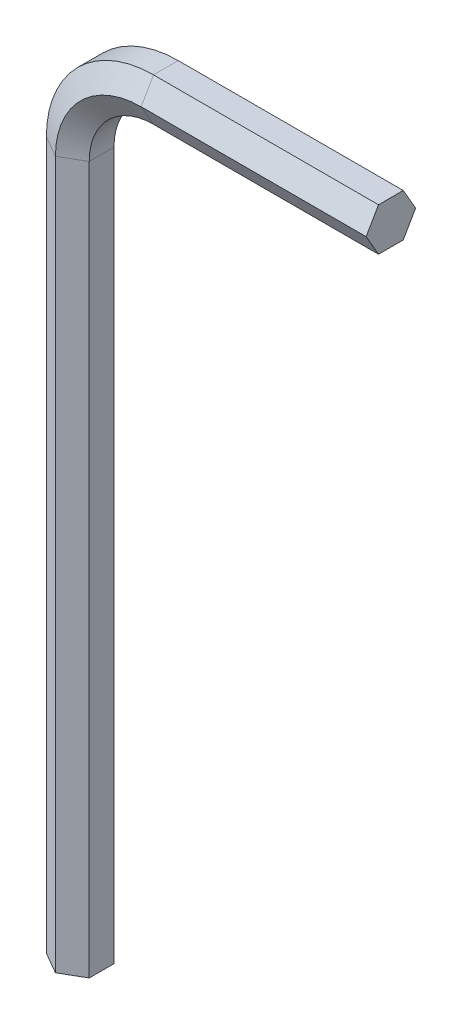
from build123d import *


with BuildPart() as part:
    # Barrer1: sweep along a path in Croquis1
    with BuildLine(Plane.XY) as barrer1_path:
        Line((0, 0), (0, 66))
        ThreePointArc((0, 66), (2.343145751, 71.656854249), (8, 74))
        Line((8, 74), (29, 74))
    # Croquis2 → Barrer1 (sweep)
    with BuildSketch(Plane(origin=(0, 0, 0), x_dir=(1, 0, 0), z_dir=(0, 1, 0))):
        Polygon((0, 2.309401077), (-2, 1.154700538), (-2, -1.154700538), (0, -2.309401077), (2, -1.154700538), (2, 1.154700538), align=None)
    sweep(path=barrer1_path.line)


solid = part.part
